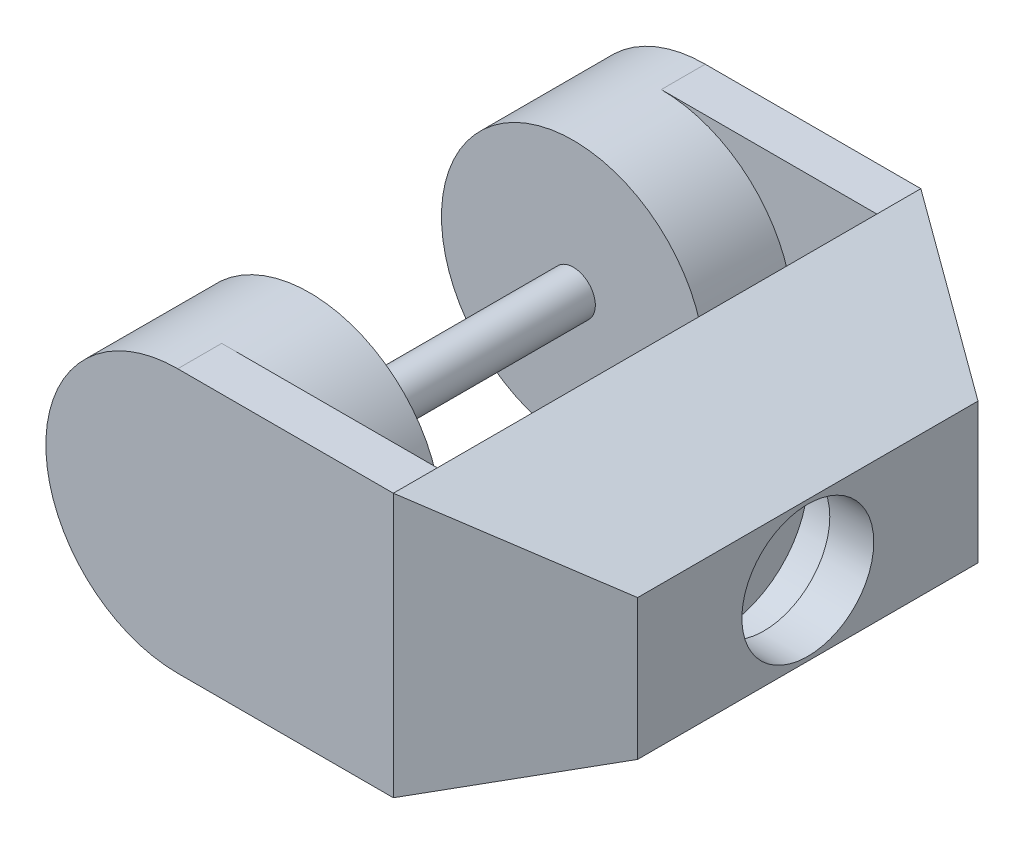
from build123d import *

# Parameters (mm, degrees)
SKETCH1_R           = 5
BOSS_EXTRUDE1_DEPTH = 30
SKETCH2_R           = 30
BOSS_EXTRUDE2_DEPTH = 20
BOSS_EXTRUDE3_DEPTH = 10
BOSS_EXTRUDE4_DEPTH = 60
CUT_EXTRUDE2_DEPTH  = 107.979678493
SKETCH8_R           = 15
CUT_EXTRUDE3_DEPTH  = 10
SKETCH9_R           = 20
CUT_EXTRUDE4_DEPTH  = 10


with BuildPart() as part:
    # Sketch1 → Boss-Extrude1 (new, symmetric)
    with BuildSketch(Plane.XY):
        Circle(SKETCH1_R)
    extrude(amount=BOSS_EXTRUDE1_DEPTH, both=True)

    # Sketch2 → Boss-Extrude2 (add)
    with BuildSketch(Plane.XY.offset(30)):
        Circle(SKETCH2_R)
    boss_extrude2 = extrude(amount=BOSS_EXTRUDE2_DEPTH)

    # Mirror1: Boss-Extrude2 across plane
    add(boss_extrude2.mirror(Plane.XY))

    # Sketch5 → Boss-Extrude3 (add)
    with BuildSketch(Plane.XY.offset(50)):
        with BuildLine():
            Line((49.046850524, 30), (49.046850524, -30))
            Line((49.046850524, -30), (0, -30))
            ThreePointArc((0, -30), (-30, 0), (0, 30))
            Line((0, 30), (49.046850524, 30))
        make_face()
    boss_extrude3 = extrude(amount=BOSS_EXTRUDE3_DEPTH)

    # Mirror3: Boss-Extrude3 across plane
    add(boss_extrude3.mirror(Plane.XY))

    # Sketch6 → Boss-Extrude4 (add, symmetric)
    with BuildSketch(Plane.XY):
        Polygon((49.046850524, -30), (49.046850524, 30), (83.33457632, 15.942663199), (83.33457632, -15.942663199), align=None)
    extrude(amount=BOSS_EXTRUDE4_DEPTH, both=True)

    # Sketch7 → Cut-Extrude2 (cut, symmetric)
    with BuildSketch(Plane(origin=(0, 0, 0), x_dir=(1, 0, 0), z_dir=(0, 1, 0))):
        Polygon((-220.635461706, 227.409893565), (49.046850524, 60), (92.240822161, 33.186605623), (361.923134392, -134.223287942), (696.742921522, 405.141336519), (114.184325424, 766.774518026), align=None)
    cut_extrude2 = extrude(amount=CUT_EXTRUDE2_DEPTH, both=True, mode=Mode.SUBTRACT)

    # Mirror4: Cut-Extrude2 across plane
    add(cut_extrude2.mirror(Plane.XY), mode=Mode.SUBTRACT)

    # Sketch8 → Cut-Extrude3 (cut)
    with BuildSketch(Plane(origin=(83.33457632, 0, 0), x_dir=(0, 0, -1), z_dir=(1, 0, 0))):
        Circle(SKETCH8_R)
    extrude(amount=-CUT_EXTRUDE3_DEPTH, mode=Mode.SUBTRACT)

    # Sketch9 → Cut-Extrude4 (cut)
    with BuildSketch(Plane(origin=(73.33457632, 0, 0), x_dir=(0, 0, -1), z_dir=(1, 0, 0))):
        Circle(SKETCH9_R)
    extrude(amount=-CUT_EXTRUDE4_DEPTH, mode=Mode.SUBTRACT)


solid = part.part
